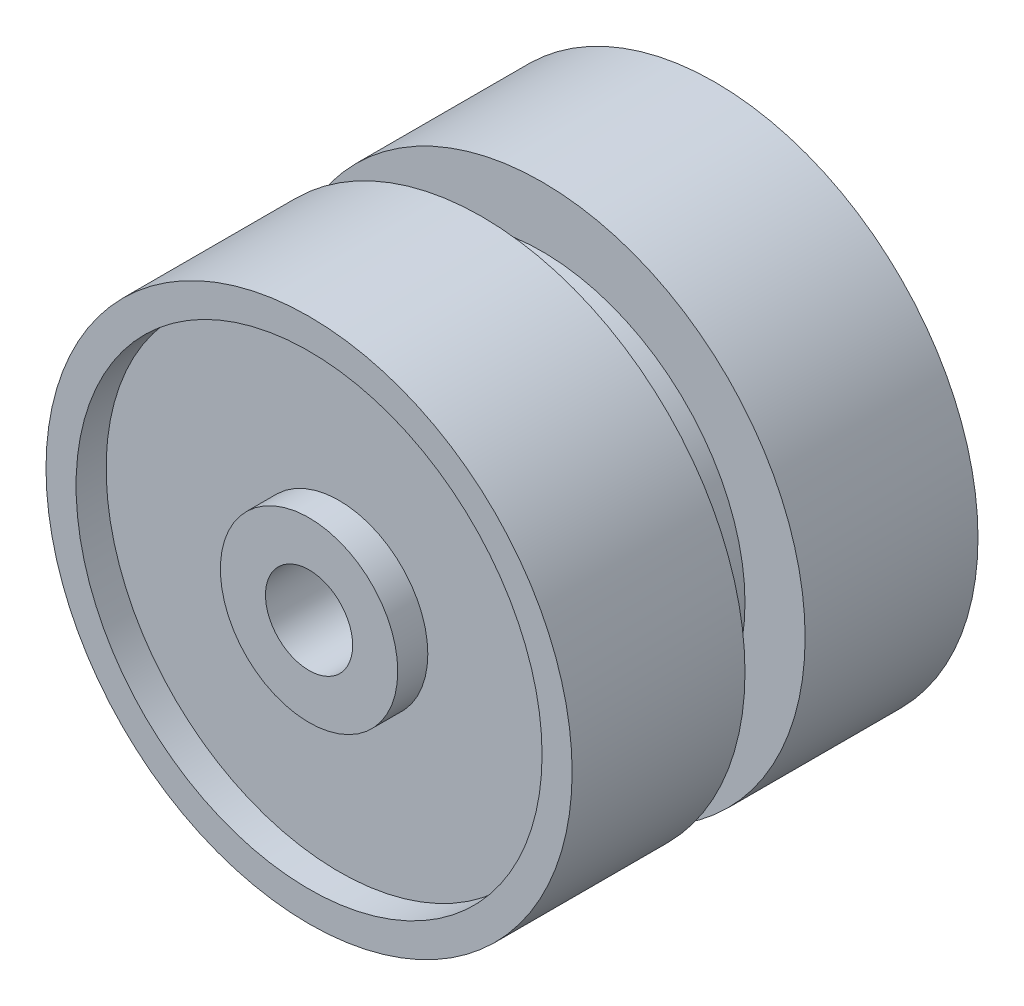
ISO-10303-21;
HEADER;
FILE_DESCRIPTION(('STEP AP214'),'2;1');
FILE_NAME('part.step','',(''),(''),'','','');
FILE_SCHEMA(('AUTOMOTIVE_DESIGN { 1 0 10303 214 1 1 1 1 }'));
ENDSEC;
DATA;
#1=APPLICATION_CONTEXT('core data for automotive mechanical design processes');
#2=APPLICATION_PROTOCOL_DEFINITION('international standard','automotive_design',2000,#1);
#3=PRODUCT_CONTEXT('',#1,'mechanical');
#4=PRODUCT('Part','Part','',(#3));
#5=PRODUCT_RELATED_PRODUCT_CATEGORY('part','',(#4));
#6=PRODUCT_DEFINITION_FORMATION('','',#4);
#7=PRODUCT_DEFINITION_CONTEXT('part definition',#1,'design');
#8=PRODUCT_DEFINITION('design','',#6,#7);
#9=PRODUCT_DEFINITION_SHAPE('','',#8);
#10=(LENGTH_UNIT() NAMED_UNIT(*) SI_UNIT(.MILLI.,.METRE.));
#11=(NAMED_UNIT(*) PLANE_ANGLE_UNIT() SI_UNIT($,.RADIAN.));
#12=(NAMED_UNIT(*) SI_UNIT($,.STERADIAN.) SOLID_ANGLE_UNIT());
#13=UNCERTAINTY_MEASURE_WITH_UNIT(LENGTH_MEASURE(1.E-05),#10,'distance_accuracy_value','');
#14=(GEOMETRIC_REPRESENTATION_CONTEXT(3) GLOBAL_UNCERTAINTY_ASSIGNED_CONTEXT((#13)) GLOBAL_UNIT_ASSIGNED_CONTEXT((#10,
#11,#12)) REPRESENTATION_CONTEXT('',''));
#15=CARTESIAN_POINT('',(0.,0.,0.));
#16=DIRECTION('',(0.,0.,1.));
#17=DIRECTION('',(1.,0.,0.));
#18=AXIS2_PLACEMENT_3D('',#15,#16,#17);
#19=CARTESIAN_POINT('',(0.,8.75,6.75));
#20=DIRECTION('',(0.,0.,-1.));
#21=DIRECTION('',(-1.,0.,0.));
#22=AXIS2_PLACEMENT_3D('',#19,#20,#21);
#23=PLANE('',#22);
#24=CARTESIAN_POINT('',(0.,0.,6.75));
#25=DIRECTION('',(0.,0.,1.));
#26=DIRECTION('',(1.,0.,0.));
#27=AXIS2_PLACEMENT_3D('',#24,#25,#26);
#28=CIRCLE('',#27,1.45);
#29=CARTESIAN_POINT('',(1.45,0.,6.75));
#30=VERTEX_POINT('',#29);
#31=EDGE_CURVE('E44',#30,#30,#28,.T.);
#32=ORIENTED_EDGE('',*,*,#31,.F.);
#33=EDGE_LOOP('',(#32));
#34=FACE_BOUND('',#33,.T.);
#35=CARTESIAN_POINT('',(0.,0.,6.75));
#36=DIRECTION('',(0.,0.,1.));
#37=DIRECTION('',(1.,0.,0.));
#38=AXIS2_PLACEMENT_3D('',#35,#36,#37);
#39=CIRCLE('',#38,2.95);
#40=CARTESIAN_POINT('',(2.95,0.,6.75));
#41=VERTEX_POINT('',#40);
#42=EDGE_CURVE('E76',#41,#41,#39,.T.);
#43=ORIENTED_EDGE('',*,*,#42,.T.);
#44=EDGE_LOOP('',(#43));
#45=FACE_BOUND('',#44,.T.);
#46=ADVANCED_FACE('F37',(#34,#45),#23,.F.);
#47=CARTESIAN_POINT('',(0.,0.,15.7877691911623));
#48=DIRECTION('',(0.,0.,1.));
#49=DIRECTION('',(1.,0.,0.));
#50=AXIS2_PLACEMENT_3D('',#47,#48,#49);
#51=CYLINDRICAL_SURFACE('',#50,8.75);
#52=CARTESIAN_POINT('',(0.,0.,6.75));
#53=DIRECTION('',(0.,0.,1.));
#54=DIRECTION('',(1.,0.,0.));
#55=AXIS2_PLACEMENT_3D('',#52,#53,#54);
#56=CIRCLE('',#55,8.75);
#57=CARTESIAN_POINT('',(8.75,0.,6.75));
#58=VERTEX_POINT('',#57);
#59=EDGE_CURVE('E10',#58,#58,#56,.T.);
#60=ORIENTED_EDGE('',*,*,#59,.F.);
#61=EDGE_LOOP('',(#60));
#62=FACE_BOUND('',#61,.T.);
#63=CARTESIAN_POINT('',(0.,0.,1.));
#64=DIRECTION('',(0.,0.,1.));
#65=DIRECTION('',(1.,0.,0.));
#66=AXIS2_PLACEMENT_3D('',#63,#64,#65);
#67=CIRCLE('',#66,8.75);
#68=CARTESIAN_POINT('',(8.75,0.,1.));
#69=VERTEX_POINT('',#68);
#70=EDGE_CURVE('E66',#69,#69,#67,.T.);
#71=ORIENTED_EDGE('',*,*,#70,.T.);
#72=EDGE_LOOP('',(#71));
#73=FACE_BOUND('',#72,.T.);
#74=ADVANCED_FACE('F39',(#62,#73),#51,.T.);
#75=CARTESIAN_POINT('',(0.,0.,6.75));
#76=DIRECTION('',(0.,0.,1.));
#77=DIRECTION('',(1.,0.,0.));
#78=AXIS2_PLACEMENT_3D('',#75,#76,#77);
#79=CIRCLE('',#78,7.75);
#80=CARTESIAN_POINT('',(7.75,0.,6.75));
#81=VERTEX_POINT('',#80);
#82=EDGE_CURVE('E70',#81,#81,#79,.T.);
#83=ORIENTED_EDGE('',*,*,#82,.F.);
#84=EDGE_LOOP('',(#83));
#85=FACE_BOUND('',#84,.T.);
#86=ORIENTED_EDGE('',*,*,#59,.T.);
#87=EDGE_LOOP('',(#86));
#88=FACE_BOUND('',#87,.T.);
#89=ADVANCED_FACE('F98',(#85,#88),#23,.F.);
#90=CARTESIAN_POINT('',(0.,0.,15.7877691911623));
#91=DIRECTION('',(0.,0.,1.));
#92=DIRECTION('',(1.,0.,0.));
#93=AXIS2_PLACEMENT_3D('',#90,#91,#92);
#94=CYLINDRICAL_SURFACE('',#93,1.45);
#95=CARTESIAN_POINT('',(0.,0.,-6.75));
#96=DIRECTION('',(0.,0.,1.));
#97=DIRECTION('',(1.,0.,0.));
#98=AXIS2_PLACEMENT_3D('',#95,#96,#97);
#99=CIRCLE('',#98,1.45);
#100=CARTESIAN_POINT('',(1.45,0.,-6.75));
#101=VERTEX_POINT('',#100);
#102=EDGE_CURVE('E48',#101,#101,#99,.T.);
#103=ORIENTED_EDGE('',*,*,#102,.F.);
#104=EDGE_LOOP('',(#103));
#105=FACE_BOUND('',#104,.T.);
#106=ORIENTED_EDGE('',*,*,#31,.T.);
#107=EDGE_LOOP('',(#106));
#108=FACE_BOUND('',#107,.T.);
#109=ADVANCED_FACE('F100',(#105,#108),#94,.F.);
#110=CARTESIAN_POINT('',(0.,1.45,-6.75));
#111=DIRECTION('',(0.,0.,1.));
#112=DIRECTION('',(1.,0.,0.));
#113=AXIS2_PLACEMENT_3D('',#110,#111,#112);
#114=PLANE('',#113);
#115=CARTESIAN_POINT('',(0.,0.,-6.75));
#116=DIRECTION('',(0.,0.,1.));
#117=DIRECTION('',(1.,0.,0.));
#118=AXIS2_PLACEMENT_3D('',#115,#116,#117);
#119=CIRCLE('',#118,8.75);
#120=CARTESIAN_POINT('',(8.75,0.,-6.75));
#121=VERTEX_POINT('',#120);
#122=EDGE_CURVE('E52',#121,#121,#119,.T.);
#123=ORIENTED_EDGE('',*,*,#122,.F.);
#124=EDGE_LOOP('',(#123));
#125=FACE_BOUND('',#124,.T.);
#126=ORIENTED_EDGE('',*,*,#102,.T.);
#127=EDGE_LOOP('',(#126));
#128=FACE_BOUND('',#127,.T.);
#129=ADVANCED_FACE('F105',(#125,#128),#114,.F.);
#130=CARTESIAN_POINT('',(0.,0.,15.7877691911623));
#131=DIRECTION('',(0.,0.,1.));
#132=DIRECTION('',(1.,0.,0.));
#133=AXIS2_PLACEMENT_3D('',#130,#131,#132);
#134=CYLINDRICAL_SURFACE('',#133,8.75);
#135=CARTESIAN_POINT('',(0.,0.,-1.));
#136=DIRECTION('',(0.,0.,1.));
#137=DIRECTION('',(1.,0.,0.));
#138=AXIS2_PLACEMENT_3D('',#135,#136,#137);
#139=CIRCLE('',#138,8.75);
#140=CARTESIAN_POINT('',(8.75,0.,-1.));
#141=VERTEX_POINT('',#140);
#142=EDGE_CURVE('E57',#141,#141,#139,.T.);
#143=ORIENTED_EDGE('',*,*,#142,.F.);
#144=EDGE_LOOP('',(#143));
#145=FACE_BOUND('',#144,.T.);
#146=ORIENTED_EDGE('',*,*,#122,.T.);
#147=EDGE_LOOP('',(#146));
#148=FACE_BOUND('',#147,.T.);
#149=ADVANCED_FACE('F130',(#145,#148),#134,.T.);
#150=CARTESIAN_POINT('',(0.,8.75,-1.));
#151=DIRECTION('',(0.,0.,-1.));
#152=DIRECTION('',(-1.,0.,0.));
#153=AXIS2_PLACEMENT_3D('',#150,#151,#152);
#154=PLANE('',#153);
#155=CARTESIAN_POINT('',(0.,0.,-1.));
#156=DIRECTION('',(0.,0.,1.));
#157=DIRECTION('',(1.,0.,0.));
#158=AXIS2_PLACEMENT_3D('',#155,#156,#157);
#159=CIRCLE('',#158,6.75);
#160=CARTESIAN_POINT('',(6.75,0.,-1.));
#161=VERTEX_POINT('',#160);
#162=EDGE_CURVE('E60',#161,#161,#159,.T.);
#163=ORIENTED_EDGE('',*,*,#162,.F.);
#164=EDGE_LOOP('',(#163));
#165=FACE_BOUND('',#164,.T.);
#166=ORIENTED_EDGE('',*,*,#142,.T.);
#167=EDGE_LOOP('',(#166));
#168=FACE_BOUND('',#167,.T.);
#169=ADVANCED_FACE('F126',(#165,#168),#154,.F.);
#170=CARTESIAN_POINT('',(0.,0.,15.7877691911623));
#171=DIRECTION('',(0.,0.,1.));
#172=DIRECTION('',(1.,0.,0.));
#173=AXIS2_PLACEMENT_3D('',#170,#171,#172);
#174=CYLINDRICAL_SURFACE('',#173,6.75);
#175=CARTESIAN_POINT('',(0.,0.,1.));
#176=DIRECTION('',(0.,0.,1.));
#177=DIRECTION('',(1.,0.,0.));
#178=AXIS2_PLACEMENT_3D('',#175,#176,#177);
#179=CIRCLE('',#178,6.75);
#180=CARTESIAN_POINT('',(6.75,0.,1.));
#181=VERTEX_POINT('',#180);
#182=EDGE_CURVE('E63',#181,#181,#179,.T.);
#183=ORIENTED_EDGE('',*,*,#182,.F.);
#184=EDGE_LOOP('',(#183));
#185=FACE_BOUND('',#184,.T.);
#186=ORIENTED_EDGE('',*,*,#162,.T.);
#187=EDGE_LOOP('',(#186));
#188=FACE_BOUND('',#187,.T.);
#189=ADVANCED_FACE('F122',(#185,#188),#174,.T.);
#190=CARTESIAN_POINT('',(0.,6.75,1.));
#191=DIRECTION('',(0.,0.,1.));
#192=DIRECTION('',(1.,0.,0.));
#193=AXIS2_PLACEMENT_3D('',#190,#191,#192);
#194=PLANE('',#193);
#195=ORIENTED_EDGE('',*,*,#70,.F.);
#196=EDGE_LOOP('',(#195));
#197=FACE_BOUND('',#196,.T.);
#198=ORIENTED_EDGE('',*,*,#182,.T.);
#199=EDGE_LOOP('',(#198));
#200=FACE_BOUND('',#199,.T.);
#201=ADVANCED_FACE('F94',(#197,#200),#194,.F.);
#202=CARTESIAN_POINT('',(0.,0.,5.75));
#203=DIRECTION('',(0.,0.,1.));
#204=DIRECTION('',(1.,0.,0.));
#205=AXIS2_PLACEMENT_3D('',#202,#203,#204);
#206=CYLINDRICAL_SURFACE('',#205,7.75);
#207=CARTESIAN_POINT('',(0.,0.,5.75));
#208=DIRECTION('',(0.,0.,1.));
#209=DIRECTION('',(1.,0.,0.));
#210=AXIS2_PLACEMENT_3D('',#207,#208,#209);
#211=CIRCLE('',#210,7.75);
#212=CARTESIAN_POINT('',(7.75,0.,5.75));
#213=VERTEX_POINT('',#212);
#214=EDGE_CURVE('E69',#213,#213,#211,.T.);
#215=ORIENTED_EDGE('',*,*,#214,.F.);
#216=EDGE_LOOP('',(#215));
#217=FACE_BOUND('',#216,.T.);
#218=ORIENTED_EDGE('',*,*,#82,.T.);
#219=EDGE_LOOP('',(#218));
#220=FACE_BOUND('',#219,.T.);
#221=ADVANCED_FACE('F88',(#217,#220),#206,.F.);
#222=CARTESIAN_POINT('',(0.,0.,5.75));
#223=DIRECTION('',(0.,0.,1.));
#224=DIRECTION('',(1.,0.,0.));
#225=AXIS2_PLACEMENT_3D('',#222,#223,#224);
#226=PLANE('',#225);
#227=CARTESIAN_POINT('',(0.,0.,5.75));
#228=DIRECTION('',(0.,0.,1.));
#229=DIRECTION('',(1.,0.,0.));
#230=AXIS2_PLACEMENT_3D('',#227,#228,#229);
#231=CIRCLE('',#230,2.95);
#232=CARTESIAN_POINT('',(2.95,0.,5.75));
#233=VERTEX_POINT('',#232);
#234=EDGE_CURVE('E73',#233,#233,#231,.T.);
#235=ORIENTED_EDGE('',*,*,#234,.F.);
#236=EDGE_LOOP('',(#235));
#237=FACE_BOUND('',#236,.T.);
#238=ORIENTED_EDGE('',*,*,#214,.T.);
#239=EDGE_LOOP('',(#238));
#240=FACE_BOUND('',#239,.T.);
#241=ADVANCED_FACE('F85',(#237,#240),#226,.T.);
#242=CARTESIAN_POINT('',(0.,0.,5.75));
#243=DIRECTION('',(0.,0.,1.));
#244=DIRECTION('',(1.,0.,0.));
#245=AXIS2_PLACEMENT_3D('',#242,#243,#244);
#246=CYLINDRICAL_SURFACE('',#245,2.95);
#247=ORIENTED_EDGE('',*,*,#234,.T.);
#248=EDGE_LOOP('',(#247));
#249=FACE_BOUND('',#248,.T.);
#250=ORIENTED_EDGE('',*,*,#42,.F.);
#251=EDGE_LOOP('',(#250));
#252=FACE_BOUND('',#251,.T.);
#253=ADVANCED_FACE('F82',(#249,#252),#246,.T.);
#254=CLOSED_SHELL('',(#46,#74,#89,#109,#129,#149,#169,#189,#201,#221,#241,#253));
#255=MANIFOLD_SOLID_BREP('B2',#254);
#256=ADVANCED_BREP_SHAPE_REPRESENTATION('',(#18,#255),#14);
#257=SHAPE_DEFINITION_REPRESENTATION(#9,#256);
ENDSEC;
END-ISO-10303-21;
